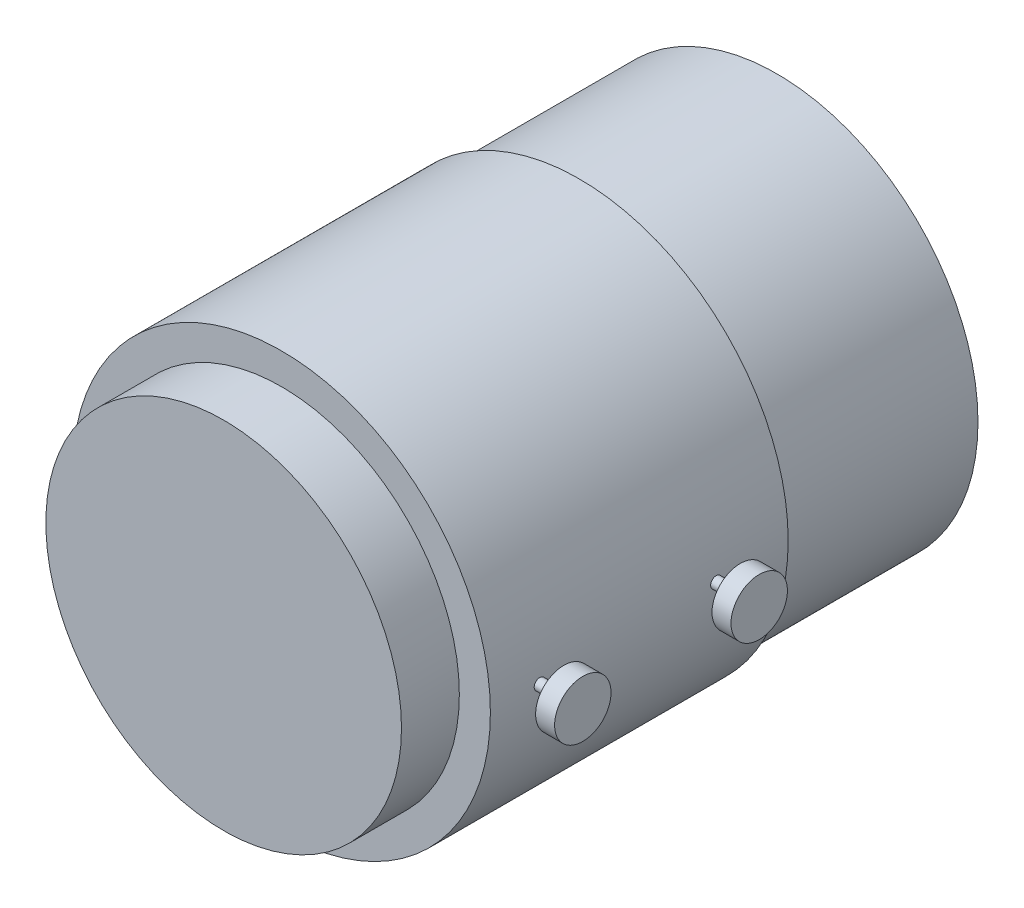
from build123d import *

# Parameters (mm, degrees)
SKETCH1_R           = 14.8
LENS_BASE_DEPTH     = 21.1
SKETCH2_R           = 12.6
MOUNT_THREADS_DEPTH = 4.1
SKETCH3_R           = 14.25
FOCUS_RING_DEPTH    = 14


with BuildPart() as part:
    # Sketch1 → lens_base (new body)
    with BuildSketch(Plane.XY):
        Circle(SKETCH1_R)
    extrude(amount=LENS_BASE_DEPTH)

    # Sketch2 → mount_threads (add)
    with BuildSketch(Plane.XY.offset(21.1)):
        Circle(SKETCH2_R)
    extrude(amount=MOUNT_THREADS_DEPTH)

    # Sketch3 → focus_ring (add)
    with BuildSketch(Plane(origin=(0, 0, 0), x_dir=(-1, 0, 0), z_dir=(0, 0, -1))):
        with Locations(Location((0, 0, 0), (0, 0, 180))):
            Circle(SKETCH3_R)
    extrude(amount=FOCUS_RING_DEPTH)

    # Sketch4 → Revolve1 (revolve)
    with BuildSketch(Plane(origin=(0, 0, 0), x_dir=(1, 0, 0), z_dir=(0, 1, 0)), mode=Mode.PRIVATE) as revolve1_sk:
        Polygon((16.503749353, -4.704632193), (0, -4.704632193), (0, -5.1), (17.848, -5.1), (17.848, -3.1), (16.503749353, -3.1), align=None)
    revolve(revolve1_sk.sketch.rotate(Axis((0, 0, 5.1), (1, 0, 0)), 180), axis=Axis((0, 0, 5.1), (1, 0, 0)))

    # Sketch4_3 → Revolve2 (revolve)
    with BuildSketch(Plane(origin=(0, 0, 0), x_dir=(1, 0, 0), z_dir=(0, 1, 0)), mode=Mode.PRIVATE) as revolve2_sk:
        Polygon((16.503749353, -17.204632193), (0, -17.204632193), (0, -17.6), (17.848, -17.6), (17.848, -15.6), (16.503749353, -15.6), align=None)
    revolve(revolve2_sk.sketch.rotate(Axis((0, 0, 17.6), (1, 0, 0)), 180), axis=Axis((0, 0, 17.6), (1, 0, 0)))


solid = part.part
